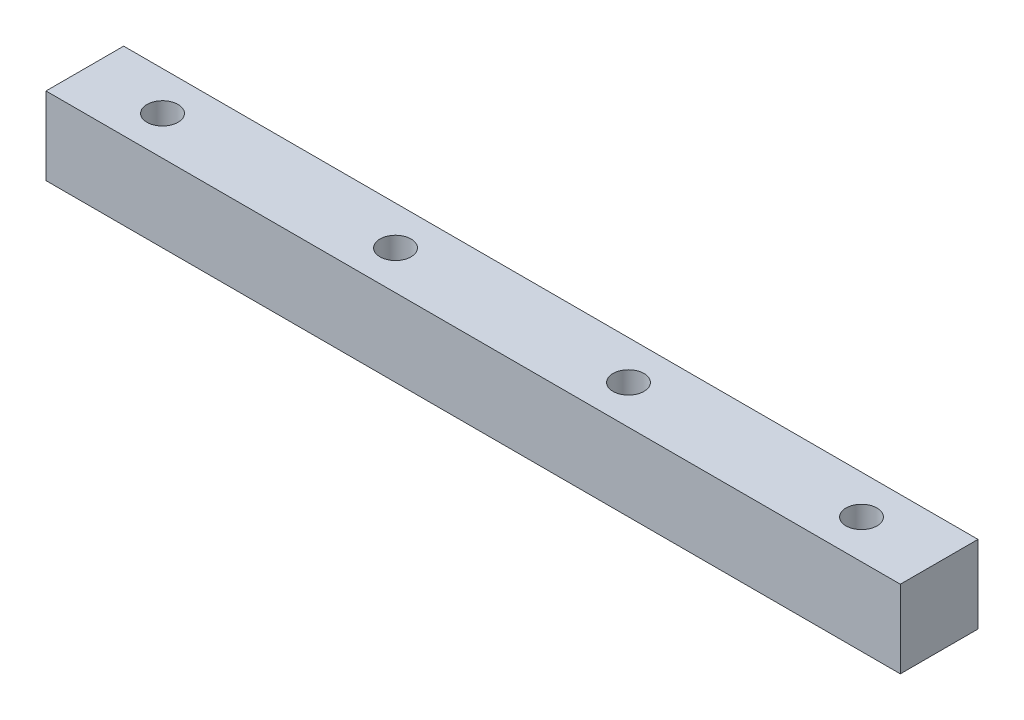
ISO-10303-21;
HEADER;
FILE_DESCRIPTION(('STEP AP214'),'2;1');
FILE_NAME('part.step','',(''),(''),'','','');
FILE_SCHEMA(('AUTOMOTIVE_DESIGN { 1 0 10303 214 1 1 1 1 }'));
ENDSEC;
DATA;
#1=APPLICATION_CONTEXT('core data for automotive mechanical design processes');
#2=APPLICATION_PROTOCOL_DEFINITION('international standard','automotive_design',2000,#1);
#3=PRODUCT_CONTEXT('',#1,'mechanical');
#4=PRODUCT('Part','Part','',(#3));
#5=PRODUCT_RELATED_PRODUCT_CATEGORY('part','',(#4));
#6=PRODUCT_DEFINITION_FORMATION('','',#4);
#7=PRODUCT_DEFINITION_CONTEXT('part definition',#1,'design');
#8=PRODUCT_DEFINITION('design','',#6,#7);
#9=PRODUCT_DEFINITION_SHAPE('','',#8);
#10=(LENGTH_UNIT() NAMED_UNIT(*) SI_UNIT(.MILLI.,.METRE.));
#11=(NAMED_UNIT(*) PLANE_ANGLE_UNIT() SI_UNIT($,.RADIAN.));
#12=(NAMED_UNIT(*) SI_UNIT($,.STERADIAN.) SOLID_ANGLE_UNIT());
#13=UNCERTAINTY_MEASURE_WITH_UNIT(LENGTH_MEASURE(1.E-05),#10,'distance_accuracy_value','');
#14=(GEOMETRIC_REPRESENTATION_CONTEXT(3) GLOBAL_UNCERTAINTY_ASSIGNED_CONTEXT((#13)) GLOBAL_UNIT_ASSIGNED_CONTEXT((#10,
#11,#12)) REPRESENTATION_CONTEXT('',''));
#15=CARTESIAN_POINT('',(0.,0.,0.));
#16=DIRECTION('',(0.,0.,1.));
#17=DIRECTION('',(1.,0.,0.));
#18=AXIS2_PLACEMENT_3D('',#15,#16,#17);
#19=CARTESIAN_POINT('',(100.,0.,5.));
#20=DIRECTION('',(0.,1.,0.));
#21=DIRECTION('',(0.,0.,1.));
#22=AXIS2_PLACEMENT_3D('',#19,#20,#21);
#23=CYLINDRICAL_SURFACE('',#22,2.);
#24=CARTESIAN_POINT('',(100.,0.,5.));
#25=DIRECTION('',(0.,1.,0.));
#26=DIRECTION('',(0.,0.,1.));
#27=AXIS2_PLACEMENT_3D('',#24,#25,#26);
#28=CIRCLE('',#27,2.);
#29=CARTESIAN_POINT('',(100.,0.,7.));
#30=VERTEX_POINT('',#29);
#31=EDGE_CURVE('E48',#30,#30,#28,.T.);
#32=ORIENTED_EDGE('',*,*,#31,.F.);
#33=EDGE_LOOP('',(#32));
#34=FACE_BOUND('',#33,.T.);
#35=CARTESIAN_POINT('',(100.,10.,5.));
#36=DIRECTION('',(0.,1.,0.));
#37=DIRECTION('',(0.,0.,1.));
#38=AXIS2_PLACEMENT_3D('',#35,#36,#37);
#39=CIRCLE('',#38,2.);
#40=CARTESIAN_POINT('',(100.,10.,7.));
#41=VERTEX_POINT('',#40);
#42=EDGE_CURVE('E11',#41,#41,#39,.T.);
#43=ORIENTED_EDGE('',*,*,#42,.T.);
#44=EDGE_LOOP('',(#43));
#45=FACE_BOUND('',#44,.T.);
#46=ADVANCED_FACE('F39',(#34,#45),#23,.F.);
#47=CARTESIAN_POINT('',(70.,0.,5.));
#48=DIRECTION('',(0.,1.,0.));
#49=DIRECTION('',(0.,0.,1.));
#50=AXIS2_PLACEMENT_3D('',#47,#48,#49);
#51=CYLINDRICAL_SURFACE('',#50,2.);
#52=CARTESIAN_POINT('',(70.,0.,5.));
#53=DIRECTION('',(0.,1.,0.));
#54=DIRECTION('',(0.,0.,1.));
#55=AXIS2_PLACEMENT_3D('',#52,#53,#54);
#56=CIRCLE('',#55,2.);
#57=CARTESIAN_POINT('',(70.,0.,7.));
#58=VERTEX_POINT('',#57);
#59=EDGE_CURVE('E129',#58,#58,#56,.T.);
#60=ORIENTED_EDGE('',*,*,#59,.F.);
#61=EDGE_LOOP('',(#60));
#62=FACE_BOUND('',#61,.T.);
#63=CARTESIAN_POINT('',(70.,10.,5.));
#64=DIRECTION('',(0.,1.,0.));
#65=DIRECTION('',(0.,0.,1.));
#66=AXIS2_PLACEMENT_3D('',#63,#64,#65);
#67=CIRCLE('',#66,2.);
#68=CARTESIAN_POINT('',(70.,10.,7.));
#69=VERTEX_POINT('',#68);
#70=EDGE_CURVE('E133',#69,#69,#67,.T.);
#71=ORIENTED_EDGE('',*,*,#70,.T.);
#72=EDGE_LOOP('',(#71));
#73=FACE_BOUND('',#72,.T.);
#74=ADVANCED_FACE('F143',(#62,#73),#51,.F.);
#75=CARTESIAN_POINT('',(0.,0.,10.));
#76=DIRECTION('',(1.,0.,0.));
#77=DIRECTION('',(0.,0.,-1.));
#78=AXIS2_PLACEMENT_3D('',#75,#76,#77);
#79=PLANE('',#78);
#80=DIRECTION('',(0.,-1.,0.));
#81=VECTOR('',#80,1.);
#82=CARTESIAN_POINT('',(0.,0.,0.));
#83=LINE('',#82,#81);
#84=CARTESIAN_POINT('',(0.,10.,0.));
#85=VERTEX_POINT('',#84);
#86=CARTESIAN_POINT('',(0.,0.,0.));
#87=VERTEX_POINT('',#86);
#88=EDGE_CURVE('E112',#85,#87,#83,.T.);
#89=ORIENTED_EDGE('',*,*,#88,.T.);
#90=DIRECTION('',(0.,0.,-1.));
#91=VECTOR('',#90,1.);
#92=CARTESIAN_POINT('',(0.,0.,10.));
#93=LINE('',#92,#91);
#94=CARTESIAN_POINT('',(0.,0.,10.));
#95=VERTEX_POINT('',#94);
#96=EDGE_CURVE('E101',#95,#87,#93,.T.);
#97=ORIENTED_EDGE('',*,*,#96,.F.);
#98=DIRECTION('',(0.,-1.,0.));
#99=VECTOR('',#98,1.);
#100=CARTESIAN_POINT('',(0.,0.,10.));
#101=LINE('',#100,#99);
#102=CARTESIAN_POINT('',(0.,10.,10.));
#103=VERTEX_POINT('',#102);
#104=EDGE_CURVE('E92',#103,#95,#101,.T.);
#105=ORIENTED_EDGE('',*,*,#104,.F.);
#106=DIRECTION('',(0.,0.,-1.));
#107=VECTOR('',#106,1.);
#108=CARTESIAN_POINT('',(0.,10.,10.));
#109=LINE('',#108,#107);
#110=EDGE_CURVE('E108',#103,#85,#109,.T.);
#111=ORIENTED_EDGE('',*,*,#110,.T.);
#112=EDGE_LOOP('',(#89,#97,#105,#111));
#113=FACE_BOUND('',#112,.T.);
#114=ADVANCED_FACE('F163',(#113),#79,.F.);
#115=CARTESIAN_POINT('',(0.,0.,10.));
#116=DIRECTION('',(0.,1.,0.));
#117=DIRECTION('',(0.,0.,1.));
#118=AXIS2_PLACEMENT_3D('',#115,#116,#117);
#119=PLANE('',#118);
#120=CARTESIAN_POINT('',(40.,0.,5.));
#121=DIRECTION('',(0.,1.,0.));
#122=DIRECTION('',(0.,0.,1.));
#123=AXIS2_PLACEMENT_3D('',#120,#121,#122);
#124=CIRCLE('',#123,2.);
#125=CARTESIAN_POINT('',(40.,0.,7.));
#126=VERTEX_POINT('',#125);
#127=EDGE_CURVE('E240',#126,#126,#124,.T.);
#128=ORIENTED_EDGE('',*,*,#127,.T.);
#129=EDGE_LOOP('',(#128));
#130=FACE_BOUND('',#129,.T.);
#131=CARTESIAN_POINT('',(10.,0.,5.));
#132=DIRECTION('',(0.,1.,0.));
#133=DIRECTION('',(0.,0.,1.));
#134=AXIS2_PLACEMENT_3D('',#131,#132,#133);
#135=CIRCLE('',#134,2.);
#136=CARTESIAN_POINT('',(10.,0.,7.));
#137=VERTEX_POINT('',#136);
#138=EDGE_CURVE('E116',#137,#137,#135,.T.);
#139=ORIENTED_EDGE('',*,*,#138,.T.);
#140=EDGE_LOOP('',(#139));
#141=FACE_BOUND('',#140,.T.);
#142=DIRECTION('',(1.,0.,0.));
#143=VECTOR('',#142,1.);
#144=CARTESIAN_POINT('',(0.,0.,0.));
#145=LINE('',#144,#143);
#146=CARTESIAN_POINT('',(110.,0.,0.));
#147=VERTEX_POINT('',#146);
#148=EDGE_CURVE('E99',#87,#147,#145,.T.);
#149=ORIENTED_EDGE('',*,*,#148,.T.);
#150=DIRECTION('',(0.,0.,-1.));
#151=VECTOR('',#150,1.);
#152=CARTESIAN_POINT('',(110.,0.,10.));
#153=LINE('',#152,#151);
#154=CARTESIAN_POINT('',(110.,0.,10.));
#155=VERTEX_POINT('',#154);
#156=EDGE_CURVE('E96',#155,#147,#153,.T.);
#157=ORIENTED_EDGE('',*,*,#156,.F.);
#158=DIRECTION('',(1.,0.,0.));
#159=VECTOR('',#158,1.);
#160=CARTESIAN_POINT('',(0.,0.,10.));
#161=LINE('',#160,#159);
#162=EDGE_CURVE('E87',#95,#155,#161,.T.);
#163=ORIENTED_EDGE('',*,*,#162,.F.);
#164=ORIENTED_EDGE('',*,*,#96,.T.);
#165=EDGE_LOOP('',(#149,#157,#163,#164));
#166=FACE_BOUND('',#165,.T.);
#167=ORIENTED_EDGE('',*,*,#59,.T.);
#168=EDGE_LOOP('',(#167));
#169=FACE_BOUND('',#168,.T.);
#170=ORIENTED_EDGE('',*,*,#31,.T.);
#171=EDGE_LOOP('',(#170));
#172=FACE_BOUND('',#171,.T.);
#173=ADVANCED_FACE('F97',(#130,#141,#166,#169,#172),#119,.F.);
#174=CARTESIAN_POINT('',(110.,0.,10.));
#175=DIRECTION('',(-1.,0.,0.));
#176=DIRECTION('',(0.,0.,1.));
#177=AXIS2_PLACEMENT_3D('',#174,#175,#176);
#178=PLANE('',#177);
#179=DIRECTION('',(0.,1.,0.));
#180=VECTOR('',#179,1.);
#181=CARTESIAN_POINT('',(110.,0.,0.));
#182=LINE('',#181,#180);
#183=CARTESIAN_POINT('',(110.,10.,0.));
#184=VERTEX_POINT('',#183);
#185=EDGE_CURVE('E73',#147,#184,#182,.T.);
#186=ORIENTED_EDGE('',*,*,#185,.T.);
#187=DIRECTION('',(0.,0.,-1.));
#188=VECTOR('',#187,1.);
#189=CARTESIAN_POINT('',(110.,10.,10.));
#190=LINE('',#189,#188);
#191=CARTESIAN_POINT('',(110.,10.,10.));
#192=VERTEX_POINT('',#191);
#193=EDGE_CURVE('E102',#192,#184,#190,.T.);
#194=ORIENTED_EDGE('',*,*,#193,.F.);
#195=DIRECTION('',(0.,1.,0.));
#196=VECTOR('',#195,1.);
#197=CARTESIAN_POINT('',(110.,0.,10.));
#198=LINE('',#197,#196);
#199=EDGE_CURVE('E90',#155,#192,#198,.T.);
#200=ORIENTED_EDGE('',*,*,#199,.F.);
#201=ORIENTED_EDGE('',*,*,#156,.T.);
#202=EDGE_LOOP('',(#186,#194,#200,#201));
#203=FACE_BOUND('',#202,.T.);
#204=ADVANCED_FACE('F104',(#203),#178,.F.);
#205=CARTESIAN_POINT('',(0.,10.,10.));
#206=DIRECTION('',(0.,-1.,0.));
#207=DIRECTION('',(0.,0.,-1.));
#208=AXIS2_PLACEMENT_3D('',#205,#206,#207);
#209=PLANE('',#208);
#210=CARTESIAN_POINT('',(40.,10.,5.));
#211=DIRECTION('',(0.,1.,0.));
#212=DIRECTION('',(0.,0.,1.));
#213=AXIS2_PLACEMENT_3D('',#210,#211,#212);
#214=CIRCLE('',#213,2.);
#215=CARTESIAN_POINT('',(40.,10.,7.));
#216=VERTEX_POINT('',#215);
#217=EDGE_CURVE('E242',#216,#216,#214,.T.);
#218=ORIENTED_EDGE('',*,*,#217,.F.);
#219=EDGE_LOOP('',(#218));
#220=FACE_BOUND('',#219,.T.);
#221=CARTESIAN_POINT('',(10.,10.,5.));
#222=DIRECTION('',(0.,1.,0.));
#223=DIRECTION('',(0.,0.,1.));
#224=AXIS2_PLACEMENT_3D('',#221,#222,#223);
#225=CIRCLE('',#224,2.);
#226=CARTESIAN_POINT('',(10.,10.,7.));
#227=VERTEX_POINT('',#226);
#228=EDGE_CURVE('E244',#227,#227,#225,.T.);
#229=ORIENTED_EDGE('',*,*,#228,.F.);
#230=EDGE_LOOP('',(#229));
#231=FACE_BOUND('',#230,.T.);
#232=DIRECTION('',(-1.,0.,0.));
#233=VECTOR('',#232,1.);
#234=CARTESIAN_POINT('',(0.,10.,0.));
#235=LINE('',#234,#233);
#236=EDGE_CURVE('E79',#184,#85,#235,.T.);
#237=ORIENTED_EDGE('',*,*,#236,.T.);
#238=ORIENTED_EDGE('',*,*,#110,.F.);
#239=DIRECTION('',(-1.,0.,0.));
#240=VECTOR('',#239,1.);
#241=CARTESIAN_POINT('',(0.,10.,10.));
#242=LINE('',#241,#240);
#243=EDGE_CURVE('E56',#192,#103,#242,.T.);
#244=ORIENTED_EDGE('',*,*,#243,.F.);
#245=ORIENTED_EDGE('',*,*,#193,.T.);
#246=EDGE_LOOP('',(#237,#238,#244,#245));
#247=FACE_BOUND('',#246,.T.);
#248=ORIENTED_EDGE('',*,*,#70,.F.);
#249=EDGE_LOOP('',(#248));
#250=FACE_BOUND('',#249,.T.);
#251=ORIENTED_EDGE('',*,*,#42,.F.);
#252=EDGE_LOOP('',(#251));
#253=FACE_BOUND('',#252,.T.);
#254=ADVANCED_FACE('F146',(#220,#231,#247,#250,#253),#209,.F.);
#255=CARTESIAN_POINT('',(0.,0.,10.));
#256=DIRECTION('',(0.,0.,-1.));
#257=DIRECTION('',(-1.,0.,0.));
#258=AXIS2_PLACEMENT_3D('',#255,#256,#257);
#259=PLANE('',#258);
#260=ORIENTED_EDGE('',*,*,#104,.T.);
#261=ORIENTED_EDGE('',*,*,#162,.T.);
#262=ORIENTED_EDGE('',*,*,#199,.T.);
#263=ORIENTED_EDGE('',*,*,#243,.T.);
#264=EDGE_LOOP('',(#260,#261,#262,#263));
#265=FACE_BOUND('',#264,.T.);
#266=ADVANCED_FACE('F88',(#265),#259,.F.);
#267=CARTESIAN_POINT('',(0.,0.,0.));
#268=DIRECTION('',(0.,0.,-1.));
#269=DIRECTION('',(-1.,0.,0.));
#270=AXIS2_PLACEMENT_3D('',#267,#268,#269);
#271=PLANE('',#270);
#272=ORIENTED_EDGE('',*,*,#88,.F.);
#273=ORIENTED_EDGE('',*,*,#236,.F.);
#274=ORIENTED_EDGE('',*,*,#185,.F.);
#275=ORIENTED_EDGE('',*,*,#148,.F.);
#276=EDGE_LOOP('',(#272,#273,#274,#275));
#277=FACE_BOUND('',#276,.T.);
#278=ADVANCED_FACE('F154',(#277),#271,.T.);
#279=CARTESIAN_POINT('',(10.,0.,5.));
#280=DIRECTION('',(0.,1.,0.));
#281=DIRECTION('',(0.,0.,1.));
#282=AXIS2_PLACEMENT_3D('',#279,#280,#281);
#283=CYLINDRICAL_SURFACE('',#282,2.);
#284=ORIENTED_EDGE('',*,*,#138,.F.);
#285=EDGE_LOOP('',(#284));
#286=FACE_BOUND('',#285,.T.);
#287=ORIENTED_EDGE('',*,*,#228,.T.);
#288=EDGE_LOOP('',(#287));
#289=FACE_BOUND('',#288,.T.);
#290=ADVANCED_FACE('F205',(#286,#289),#283,.F.);
#291=CARTESIAN_POINT('',(40.,0.,5.));
#292=DIRECTION('',(0.,1.,0.));
#293=DIRECTION('',(0.,0.,1.));
#294=AXIS2_PLACEMENT_3D('',#291,#292,#293);
#295=CYLINDRICAL_SURFACE('',#294,2.);
#296=ORIENTED_EDGE('',*,*,#127,.F.);
#297=EDGE_LOOP('',(#296));
#298=FACE_BOUND('',#297,.T.);
#299=ORIENTED_EDGE('',*,*,#217,.T.);
#300=EDGE_LOOP('',(#299));
#301=FACE_BOUND('',#300,.T.);
#302=ADVANCED_FACE('F213',(#298,#301),#295,.F.);
#303=CLOSED_SHELL('',(#46,#74,#114,#173,#204,#254,#266,#278,#290,#302));
#304=MANIFOLD_SOLID_BREP('B2',#303);
#305=ADVANCED_BREP_SHAPE_REPRESENTATION('',(#18,#304),#14);
#306=SHAPE_DEFINITION_REPRESENTATION(#9,#305);
ENDSEC;
END-ISO-10303-21;
